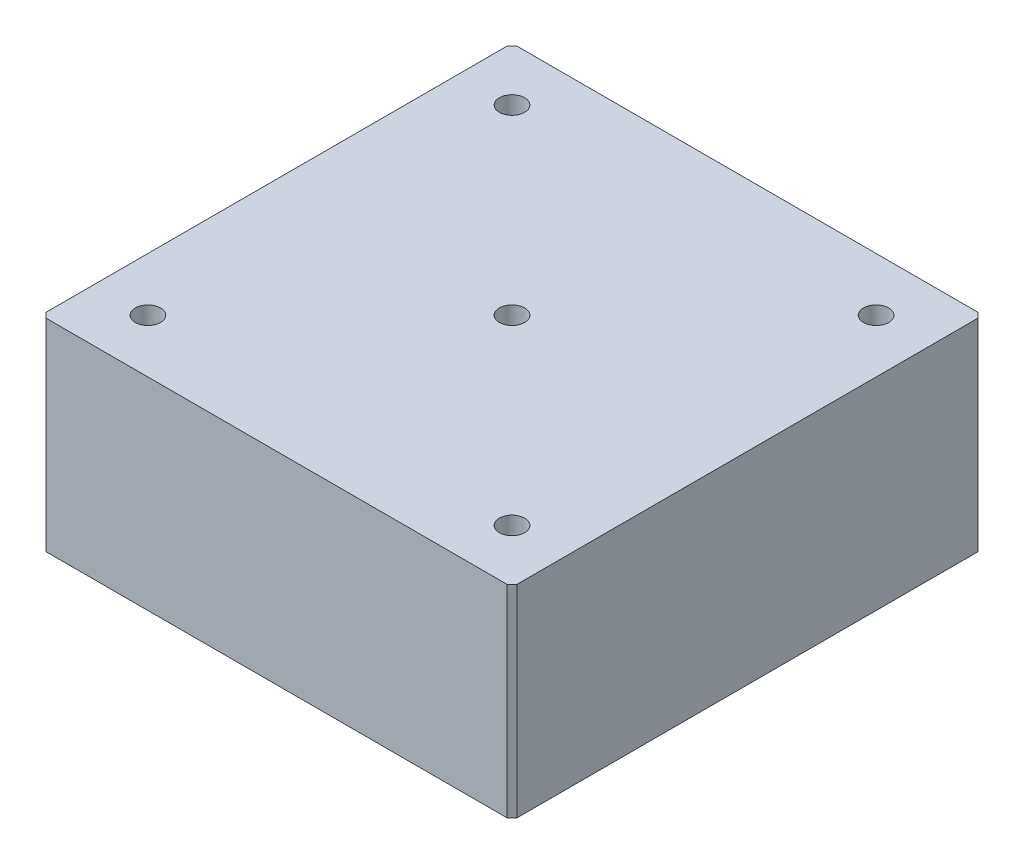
ISO-10303-21;
HEADER;
FILE_DESCRIPTION(('STEP AP214'),'2;1');
FILE_NAME('part.step','',(''),(''),'','','');
FILE_SCHEMA(('AUTOMOTIVE_DESIGN { 1 0 10303 214 1 1 1 1 }'));
ENDSEC;
DATA;
#1=APPLICATION_CONTEXT('core data for automotive mechanical design processes');
#2=APPLICATION_PROTOCOL_DEFINITION('international standard','automotive_design',2000,#1);
#3=PRODUCT_CONTEXT('',#1,'mechanical');
#4=PRODUCT('Part','Part','',(#3));
#5=PRODUCT_RELATED_PRODUCT_CATEGORY('part','',(#4));
#6=PRODUCT_DEFINITION_FORMATION('','',#4);
#7=PRODUCT_DEFINITION_CONTEXT('part definition',#1,'design');
#8=PRODUCT_DEFINITION('design','',#6,#7);
#9=PRODUCT_DEFINITION_SHAPE('','',#8);
#10=(LENGTH_UNIT() NAMED_UNIT(*) SI_UNIT(.MILLI.,.METRE.));
#11=(NAMED_UNIT(*) PLANE_ANGLE_UNIT() SI_UNIT($,.RADIAN.));
#12=(NAMED_UNIT(*) SI_UNIT($,.STERADIAN.) SOLID_ANGLE_UNIT());
#13=UNCERTAINTY_MEASURE_WITH_UNIT(LENGTH_MEASURE(1.E-05),#10,'distance_accuracy_value','');
#14=(GEOMETRIC_REPRESENTATION_CONTEXT(3) GLOBAL_UNCERTAINTY_ASSIGNED_CONTEXT((#13)) GLOBAL_UNIT_ASSIGNED_CONTEXT((#10,
#11,#12)) REPRESENTATION_CONTEXT('',''));
#15=CARTESIAN_POINT('',(0.,0.,0.));
#16=DIRECTION('',(0.,0.,1.));
#17=DIRECTION('',(1.,0.,0.));
#18=AXIS2_PLACEMENT_3D('',#15,#16,#17);
#19=CARTESIAN_POINT('',(147.88388,63.5,-147.88388));
#20=DIRECTION('',(0.,-1.,0.));
#21=DIRECTION('',(0.,0.,-1.));
#22=AXIS2_PLACEMENT_3D('',#19,#20,#21);
#23=PLANE('',#22);
#24=CARTESIAN_POINT('',(114.3,63.5,-114.3));
#25=DIRECTION('',(0.,1.,0.));
#26=DIRECTION('',(0.,0.,1.));
#27=AXIS2_PLACEMENT_3D('',#24,#25,#26);
#28=CIRCLE('',#27,7.9375);
#29=CARTESIAN_POINT('',(114.3,63.5,-106.3625));
#30=VERTEX_POINT('',#29);
#31=EDGE_CURVE('E219',#30,#30,#28,.T.);
#32=ORIENTED_EDGE('',*,*,#31,.F.);
#33=EDGE_LOOP('',(#32));
#34=FACE_BOUND('',#33,.T.);
#35=CARTESIAN_POINT('',(114.3,63.5,114.3));
#36=DIRECTION('',(0.,1.,0.));
#37=DIRECTION('',(0.,0.,1.));
#38=AXIS2_PLACEMENT_3D('',#35,#36,#37);
#39=CIRCLE('',#38,7.9375);
#40=CARTESIAN_POINT('',(114.3,63.5,122.2375));
#41=VERTEX_POINT('',#40);
#42=EDGE_CURVE('E207',#41,#41,#39,.T.);
#43=ORIENTED_EDGE('',*,*,#42,.F.);
#44=EDGE_LOOP('',(#43));
#45=FACE_BOUND('',#44,.T.);
#46=CARTESIAN_POINT('',(0.,63.5,0.));
#47=DIRECTION('',(0.,1.,0.));
#48=DIRECTION('',(0.,0.,1.));
#49=AXIS2_PLACEMENT_3D('',#46,#47,#48);
#50=CIRCLE('',#49,7.9375);
#51=CARTESIAN_POINT('',(0.,63.5,7.93749999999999));
#52=VERTEX_POINT('',#51);
#53=EDGE_CURVE('E195',#52,#52,#50,.T.);
#54=ORIENTED_EDGE('',*,*,#53,.F.);
#55=EDGE_LOOP('',(#54));
#56=FACE_BOUND('',#55,.T.);
#57=DIRECTION('',(0.,0.,1.));
#58=VECTOR('',#57,1.);
#59=CARTESIAN_POINT('',(-147.88388,63.5,147.88388));
#60=LINE('',#59,#58);
#61=CARTESIAN_POINT('',(-147.88388,63.5,-144.70888));
#62=VERTEX_POINT('',#61);
#63=CARTESIAN_POINT('',(-147.88388,63.5,144.70888));
#64=VERTEX_POINT('',#63);
#65=EDGE_CURVE('E100',#62,#64,#60,.T.);
#66=ORIENTED_EDGE('',*,*,#65,.T.);
#67=DIRECTION('',(-0.707106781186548,0.,-0.707106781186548));
#68=VECTOR('',#67,1.);
#69=CARTESIAN_POINT('',(-147.88388,63.5,144.70888));
#70=LINE('',#69,#68);
#71=CARTESIAN_POINT('',(-144.70888,63.5,147.88388));
#72=VERTEX_POINT('',#71);
#73=EDGE_CURVE('E128',#64,#72,#70,.F.);
#74=ORIENTED_EDGE('',*,*,#73,.T.);
#75=DIRECTION('',(1.,0.,0.));
#76=VECTOR('',#75,1.);
#77=CARTESIAN_POINT('',(-147.88388,63.5,147.88388));
#78=LINE('',#77,#76);
#79=CARTESIAN_POINT('',(144.70888,63.5,147.88388));
#80=VERTEX_POINT('',#79);
#81=EDGE_CURVE('E115',#72,#80,#78,.T.);
#82=ORIENTED_EDGE('',*,*,#81,.T.);
#83=DIRECTION('',(-0.707106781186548,0.,0.707106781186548));
#84=VECTOR('',#83,1.);
#85=CARTESIAN_POINT('',(144.70888,63.5,147.88388));
#86=LINE('',#85,#84);
#87=CARTESIAN_POINT('',(147.88388,63.5,144.70888));
#88=VERTEX_POINT('',#87);
#89=EDGE_CURVE('E126',#80,#88,#86,.F.);
#90=ORIENTED_EDGE('',*,*,#89,.T.);
#91=DIRECTION('',(0.,0.,-1.));
#92=VECTOR('',#91,1.);
#93=CARTESIAN_POINT('',(147.88388,63.5,147.88388));
#94=LINE('',#93,#92);
#95=CARTESIAN_POINT('',(147.88388,63.5,-144.70888));
#96=VERTEX_POINT('',#95);
#97=EDGE_CURVE('E156',#88,#96,#94,.T.);
#98=ORIENTED_EDGE('',*,*,#97,.T.);
#99=DIRECTION('',(0.707106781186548,0.,0.707106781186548));
#100=VECTOR('',#99,1.);
#101=CARTESIAN_POINT('',(147.88388,63.5,-144.70888));
#102=LINE('',#101,#100);
#103=CARTESIAN_POINT('',(144.70888,63.5,-147.88388));
#104=VERTEX_POINT('',#103);
#105=EDGE_CURVE('E106',#96,#104,#102,.F.);
#106=ORIENTED_EDGE('',*,*,#105,.T.);
#107=DIRECTION('',(-1.,0.,0.));
#108=VECTOR('',#107,1.);
#109=CARTESIAN_POINT('',(-147.88388,63.5,-147.88388));
#110=LINE('',#109,#108);
#111=CARTESIAN_POINT('',(-144.70888,63.5,-147.88388));
#112=VERTEX_POINT('',#111);
#113=EDGE_CURVE('E101',#104,#112,#110,.T.);
#114=ORIENTED_EDGE('',*,*,#113,.T.);
#115=DIRECTION('',(0.707106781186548,0.,-0.707106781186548));
#116=VECTOR('',#115,1.);
#117=CARTESIAN_POINT('',(-144.70888,63.5,-147.88388));
#118=LINE('',#117,#116);
#119=EDGE_CURVE('E97',#112,#62,#118,.F.);
#120=ORIENTED_EDGE('',*,*,#119,.T.);
#121=EDGE_LOOP('',(#66,#74,#82,#90,#98,#106,#114,#120));
#122=FACE_BOUND('',#121,.T.);
#123=CARTESIAN_POINT('',(-114.3,63.5,114.3));
#124=DIRECTION('',(0.,1.,0.));
#125=DIRECTION('',(0.,0.,1.));
#126=AXIS2_PLACEMENT_3D('',#123,#124,#125);
#127=CIRCLE('',#126,7.9375);
#128=CARTESIAN_POINT('',(-114.3,63.5,122.2375));
#129=VERTEX_POINT('',#128);
#130=EDGE_CURVE('E171',#129,#129,#127,.T.);
#131=ORIENTED_EDGE('',*,*,#130,.F.);
#132=EDGE_LOOP('',(#131));
#133=FACE_BOUND('',#132,.T.);
#134=CARTESIAN_POINT('',(-114.3,63.5,-114.3));
#135=DIRECTION('',(0.,1.,0.));
#136=DIRECTION('',(0.,0.,1.));
#137=AXIS2_PLACEMENT_3D('',#134,#135,#136);
#138=CIRCLE('',#137,7.9375);
#139=CARTESIAN_POINT('',(-114.3,63.5,-106.3625));
#140=VERTEX_POINT('',#139);
#141=EDGE_CURVE('E183',#140,#140,#138,.T.);
#142=ORIENTED_EDGE('',*,*,#141,.F.);
#143=EDGE_LOOP('',(#142));
#144=FACE_BOUND('',#143,.T.);
#145=ADVANCED_FACE('F32',(#34,#45,#56,#122,#133,#144),#23,.F.);
#146=CARTESIAN_POINT('',(147.88388,-63.5,147.88388));
#147=DIRECTION('',(1.,0.,0.));
#148=DIRECTION('',(0.,0.,-1.));
#149=AXIS2_PLACEMENT_3D('',#146,#147,#148);
#150=PLANE('',#149);
#151=ORIENTED_EDGE('',*,*,#97,.F.);
#152=DIRECTION('',(0.,-1.,0.));
#153=VECTOR('',#152,1.);
#154=CARTESIAN_POINT('',(147.88388,-63.5,144.70888));
#155=LINE('',#154,#153);
#156=CARTESIAN_POINT('',(147.88388,-63.5,144.70888));
#157=VERTEX_POINT('',#156);
#158=EDGE_CURVE('E145',#88,#157,#155,.T.);
#159=ORIENTED_EDGE('',*,*,#158,.T.);
#160=DIRECTION('',(0.,0.,-1.));
#161=VECTOR('',#160,1.);
#162=CARTESIAN_POINT('',(147.88388,-63.5,147.88388));
#163=LINE('',#162,#161);
#164=CARTESIAN_POINT('',(147.88388,-63.5,-144.70888));
#165=VERTEX_POINT('',#164);
#166=EDGE_CURVE('E149',#157,#165,#163,.T.);
#167=ORIENTED_EDGE('',*,*,#166,.T.);
#168=DIRECTION('',(0.,1.,0.));
#169=VECTOR('',#168,1.);
#170=CARTESIAN_POINT('',(147.88388,-63.5,-144.70888));
#171=LINE('',#170,#169);
#172=EDGE_CURVE('E142',#165,#96,#171,.T.);
#173=ORIENTED_EDGE('',*,*,#172,.T.);
#174=EDGE_LOOP('',(#151,#159,#167,#173));
#175=FACE_BOUND('',#174,.T.);
#176=ADVANCED_FACE('F227',(#175),#150,.T.);
#177=CARTESIAN_POINT('',(-147.88388,-63.5,147.88388));
#178=DIRECTION('',(0.,0.,1.));
#179=DIRECTION('',(1.,0.,0.));
#180=AXIS2_PLACEMENT_3D('',#177,#178,#179);
#181=PLANE('',#180);
#182=ORIENTED_EDGE('',*,*,#81,.F.);
#183=DIRECTION('',(0.,-1.,0.));
#184=VECTOR('',#183,1.);
#185=CARTESIAN_POINT('',(-144.70888,-63.5,147.88388));
#186=LINE('',#185,#184);
#187=CARTESIAN_POINT('',(-144.70888,-63.5,147.88388));
#188=VERTEX_POINT('',#187);
#189=EDGE_CURVE('E133',#72,#188,#186,.T.);
#190=ORIENTED_EDGE('',*,*,#189,.T.);
#191=DIRECTION('',(1.,0.,0.));
#192=VECTOR('',#191,1.);
#193=CARTESIAN_POINT('',(-147.88388,-63.5,147.88388));
#194=LINE('',#193,#192);
#195=CARTESIAN_POINT('',(144.70888,-63.5,147.88388));
#196=VERTEX_POINT('',#195);
#197=EDGE_CURVE('E117',#188,#196,#194,.T.);
#198=ORIENTED_EDGE('',*,*,#197,.T.);
#199=DIRECTION('',(0.,1.,0.));
#200=VECTOR('',#199,1.);
#201=CARTESIAN_POINT('',(144.70888,-63.5,147.88388));
#202=LINE('',#201,#200);
#203=EDGE_CURVE('E130',#196,#80,#202,.T.);
#204=ORIENTED_EDGE('',*,*,#203,.T.);
#205=EDGE_LOOP('',(#182,#190,#198,#204));
#206=FACE_BOUND('',#205,.T.);
#207=ADVANCED_FACE('F284',(#206),#181,.T.);
#208=CARTESIAN_POINT('',(-147.88388,-63.5,147.88388));
#209=DIRECTION('',(-1.,0.,0.));
#210=DIRECTION('',(0.,0.,1.));
#211=AXIS2_PLACEMENT_3D('',#208,#209,#210);
#212=PLANE('',#211);
#213=DIRECTION('',(0.,0.,1.));
#214=VECTOR('',#213,1.);
#215=CARTESIAN_POINT('',(-147.88388,-63.5,147.88388));
#216=LINE('',#215,#214);
#217=CARTESIAN_POINT('',(-147.88388,-63.5,-144.70888));
#218=VERTEX_POINT('',#217);
#219=CARTESIAN_POINT('',(-147.88388,-63.5,144.70888));
#220=VERTEX_POINT('',#219);
#221=EDGE_CURVE('E121',#218,#220,#216,.T.);
#222=ORIENTED_EDGE('',*,*,#221,.T.);
#223=DIRECTION('',(0.,1.,0.));
#224=VECTOR('',#223,1.);
#225=CARTESIAN_POINT('',(-147.88388,-63.5,144.70888));
#226=LINE('',#225,#224);
#227=EDGE_CURVE('E107',#220,#64,#226,.T.);
#228=ORIENTED_EDGE('',*,*,#227,.T.);
#229=ORIENTED_EDGE('',*,*,#65,.F.);
#230=DIRECTION('',(0.,-1.,0.));
#231=VECTOR('',#230,1.);
#232=CARTESIAN_POINT('',(-147.88388,-63.5,-144.70888));
#233=LINE('',#232,#231);
#234=EDGE_CURVE('E113',#62,#218,#233,.T.);
#235=ORIENTED_EDGE('',*,*,#234,.T.);
#236=EDGE_LOOP('',(#222,#228,#229,#235));
#237=FACE_BOUND('',#236,.T.);
#238=ADVANCED_FACE('F112',(#237),#212,.T.);
#239=CARTESIAN_POINT('',(-147.88388,-63.5,-147.88388));
#240=DIRECTION('',(0.,0.,-1.));
#241=DIRECTION('',(-1.,0.,0.));
#242=AXIS2_PLACEMENT_3D('',#239,#240,#241);
#243=PLANE('',#242);
#244=ORIENTED_EDGE('',*,*,#113,.F.);
#245=DIRECTION('',(0.,-1.,0.));
#246=VECTOR('',#245,1.);
#247=CARTESIAN_POINT('',(144.70888,-63.5,-147.88388));
#248=LINE('',#247,#246);
#249=CARTESIAN_POINT('',(144.70888,-63.5,-147.88388));
#250=VERTEX_POINT('',#249);
#251=EDGE_CURVE('E11',#104,#250,#248,.T.);
#252=ORIENTED_EDGE('',*,*,#251,.T.);
#253=DIRECTION('',(-1.,0.,0.));
#254=VECTOR('',#253,1.);
#255=CARTESIAN_POINT('',(-147.88388,-63.5,-147.88388));
#256=LINE('',#255,#254);
#257=CARTESIAN_POINT('',(-144.70888,-63.5,-147.88388));
#258=VERTEX_POINT('',#257);
#259=EDGE_CURVE('E147',#250,#258,#256,.T.);
#260=ORIENTED_EDGE('',*,*,#259,.T.);
#261=DIRECTION('',(0.,1.,0.));
#262=VECTOR('',#261,1.);
#263=CARTESIAN_POINT('',(-144.70888,-63.5,-147.88388));
#264=LINE('',#263,#262);
#265=EDGE_CURVE('E40',#258,#112,#264,.T.);
#266=ORIENTED_EDGE('',*,*,#265,.T.);
#267=EDGE_LOOP('',(#244,#252,#260,#266));
#268=FACE_BOUND('',#267,.T.);
#269=ADVANCED_FACE('F146',(#268),#243,.T.);
#270=CARTESIAN_POINT('',(147.88388,-63.5,-147.88388));
#271=DIRECTION('',(0.,-1.,0.));
#272=DIRECTION('',(0.,0.,-1.));
#273=AXIS2_PLACEMENT_3D('',#270,#271,#272);
#274=PLANE('',#273);
#275=CARTESIAN_POINT('',(114.3,-63.5,-114.3));
#276=DIRECTION('',(0.,1.,0.));
#277=DIRECTION('',(0.,0.,1.));
#278=AXIS2_PLACEMENT_3D('',#275,#276,#277);
#279=CIRCLE('',#278,3.37819999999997);
#280=CARTESIAN_POINT('',(114.3,-63.5,-110.9218));
#281=VERTEX_POINT('',#280);
#282=EDGE_CURVE('E210',#281,#281,#279,.T.);
#283=ORIENTED_EDGE('',*,*,#282,.T.);
#284=EDGE_LOOP('',(#283));
#285=FACE_BOUND('',#284,.T.);
#286=CARTESIAN_POINT('',(114.3,-63.5,114.3));
#287=DIRECTION('',(0.,1.,0.));
#288=DIRECTION('',(0.,0.,1.));
#289=AXIS2_PLACEMENT_3D('',#286,#287,#288);
#290=CIRCLE('',#289,3.37819999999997);
#291=CARTESIAN_POINT('',(114.3,-63.5,117.6782));
#292=VERTEX_POINT('',#291);
#293=EDGE_CURVE('E198',#292,#292,#290,.T.);
#294=ORIENTED_EDGE('',*,*,#293,.T.);
#295=EDGE_LOOP('',(#294));
#296=FACE_BOUND('',#295,.T.);
#297=CARTESIAN_POINT('',(0.,-63.5,0.));
#298=DIRECTION('',(0.,1.,0.));
#299=DIRECTION('',(0.,0.,1.));
#300=AXIS2_PLACEMENT_3D('',#297,#298,#299);
#301=CIRCLE('',#300,3.37819999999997);
#302=CARTESIAN_POINT('',(0.,-63.5,3.37819999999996));
#303=VERTEX_POINT('',#302);
#304=EDGE_CURVE('E186',#303,#303,#301,.T.);
#305=ORIENTED_EDGE('',*,*,#304,.T.);
#306=EDGE_LOOP('',(#305));
#307=FACE_BOUND('',#306,.T.);
#308=CARTESIAN_POINT('',(-114.3,-63.5,-114.3));
#309=DIRECTION('',(0.,1.,0.));
#310=DIRECTION('',(0.,0.,1.));
#311=AXIS2_PLACEMENT_3D('',#308,#309,#310);
#312=CIRCLE('',#311,3.37819999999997);
#313=CARTESIAN_POINT('',(-114.3,-63.5,-110.9218));
#314=VERTEX_POINT('',#313);
#315=EDGE_CURVE('E174',#314,#314,#312,.T.);
#316=ORIENTED_EDGE('',*,*,#315,.T.);
#317=EDGE_LOOP('',(#316));
#318=FACE_BOUND('',#317,.T.);
#319=CARTESIAN_POINT('',(-114.3,-63.5,114.3));
#320=DIRECTION('',(0.,1.,0.));
#321=DIRECTION('',(0.,0.,1.));
#322=AXIS2_PLACEMENT_3D('',#319,#320,#321);
#323=CIRCLE('',#322,3.37819999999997);
#324=CARTESIAN_POINT('',(-114.3,-63.5,117.6782));
#325=VERTEX_POINT('',#324);
#326=EDGE_CURVE('E159',#325,#325,#323,.T.);
#327=ORIENTED_EDGE('',*,*,#326,.T.);
#328=EDGE_LOOP('',(#327));
#329=FACE_BOUND('',#328,.T.);
#330=ORIENTED_EDGE('',*,*,#197,.F.);
#331=DIRECTION('',(0.707106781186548,0.,0.707106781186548));
#332=VECTOR('',#331,1.);
#333=CARTESIAN_POINT('',(-146.29638,-63.5,146.29638));
#334=LINE('',#333,#332);
#335=EDGE_CURVE('E140',#188,#220,#334,.F.);
#336=ORIENTED_EDGE('',*,*,#335,.T.);
#337=ORIENTED_EDGE('',*,*,#221,.F.);
#338=DIRECTION('',(-0.707106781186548,0.,0.707106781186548));
#339=VECTOR('',#338,1.);
#340=CARTESIAN_POINT('',(1.58749999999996,-63.5,-294.18026));
#341=LINE('',#340,#339);
#342=EDGE_CURVE('E47',#218,#258,#341,.F.);
#343=ORIENTED_EDGE('',*,*,#342,.T.);
#344=ORIENTED_EDGE('',*,*,#259,.F.);
#345=DIRECTION('',(-0.707106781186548,0.,-0.707106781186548));
#346=VECTOR('',#345,1.);
#347=CARTESIAN_POINT('',(146.29638,-63.5,-146.29638));
#348=LINE('',#347,#346);
#349=EDGE_CURVE('E136',#250,#165,#348,.F.);
#350=ORIENTED_EDGE('',*,*,#349,.T.);
#351=ORIENTED_EDGE('',*,*,#166,.F.);
#352=DIRECTION('',(0.707106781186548,0.,-0.707106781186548));
#353=VECTOR('',#352,1.);
#354=CARTESIAN_POINT('',(294.18026,-63.5,-1.58749999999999));
#355=LINE('',#354,#353);
#356=EDGE_CURVE('E138',#157,#196,#355,.F.);
#357=ORIENTED_EDGE('',*,*,#356,.T.);
#358=EDGE_LOOP('',(#330,#336,#337,#343,#344,#350,#351,#357));
#359=FACE_BOUND('',#358,.T.);
#360=ADVANCED_FACE('F279',(#285,#296,#307,#318,#329,#359),#274,.T.);
#361=CARTESIAN_POINT('',(-147.88388,-63.5,144.70888));
#362=DIRECTION('',(0.707106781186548,0.,-0.707106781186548));
#363=DIRECTION('',(-0.707106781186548,0.,-0.707106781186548));
#364=AXIS2_PLACEMENT_3D('',#361,#362,#363);
#365=PLANE('',#364);
#366=ORIENTED_EDGE('',*,*,#335,.F.);
#367=ORIENTED_EDGE('',*,*,#189,.F.);
#368=ORIENTED_EDGE('',*,*,#73,.F.);
#369=ORIENTED_EDGE('',*,*,#227,.F.);
#370=EDGE_LOOP('',(#366,#367,#368,#369));
#371=FACE_BOUND('',#370,.T.);
#372=ADVANCED_FACE('F281',(#371),#365,.F.);
#373=CARTESIAN_POINT('',(144.70888,-63.5,147.88388));
#374=DIRECTION('',(-0.707106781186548,0.,-0.707106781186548));
#375=DIRECTION('',(-0.707106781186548,0.,0.707106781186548));
#376=AXIS2_PLACEMENT_3D('',#373,#374,#375);
#377=PLANE('',#376);
#378=ORIENTED_EDGE('',*,*,#356,.F.);
#379=ORIENTED_EDGE('',*,*,#158,.F.);
#380=ORIENTED_EDGE('',*,*,#89,.F.);
#381=ORIENTED_EDGE('',*,*,#203,.F.);
#382=EDGE_LOOP('',(#378,#379,#380,#381));
#383=FACE_BOUND('',#382,.T.);
#384=ADVANCED_FACE('F297',(#383),#377,.F.);
#385=CARTESIAN_POINT('',(147.88388,-63.5,-144.70888));
#386=DIRECTION('',(-0.707106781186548,0.,0.707106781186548));
#387=DIRECTION('',(0.707106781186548,0.,0.707106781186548));
#388=AXIS2_PLACEMENT_3D('',#385,#386,#387);
#389=PLANE('',#388);
#390=ORIENTED_EDGE('',*,*,#349,.F.);
#391=ORIENTED_EDGE('',*,*,#251,.F.);
#392=ORIENTED_EDGE('',*,*,#105,.F.);
#393=ORIENTED_EDGE('',*,*,#172,.F.);
#394=EDGE_LOOP('',(#390,#391,#392,#393));
#395=FACE_BOUND('',#394,.T.);
#396=ADVANCED_FACE('F300',(#395),#389,.F.);
#397=CARTESIAN_POINT('',(-144.70888,-63.5,-147.88388));
#398=DIRECTION('',(0.707106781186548,0.,0.707106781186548));
#399=DIRECTION('',(0.707106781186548,0.,-0.707106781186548));
#400=AXIS2_PLACEMENT_3D('',#397,#398,#399);
#401=PLANE('',#400);
#402=ORIENTED_EDGE('',*,*,#342,.F.);
#403=ORIENTED_EDGE('',*,*,#234,.F.);
#404=ORIENTED_EDGE('',*,*,#119,.F.);
#405=ORIENTED_EDGE('',*,*,#265,.F.);
#406=EDGE_LOOP('',(#402,#403,#404,#405));
#407=FACE_BOUND('',#406,.T.);
#408=ADVANCED_FACE('F34',(#407),#401,.F.);
#409=CARTESIAN_POINT('',(-114.3,63.5,114.3));
#410=DIRECTION('',(0.,1.,0.));
#411=DIRECTION('',(0.,0.,1.));
#412=AXIS2_PLACEMENT_3D('',#409,#410,#411);
#413=CYLINDRICAL_SURFACE('',#412,3.37819999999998);
#414=ORIENTED_EDGE('',*,*,#326,.F.);
#415=EDGE_LOOP('',(#414));
#416=FACE_BOUND('',#415,.T.);
#417=CARTESIAN_POINT('',(-114.3,-11.176,114.3));
#418=DIRECTION('',(0.,1.,0.));
#419=DIRECTION('',(0.,0.,1.));
#420=AXIS2_PLACEMENT_3D('',#417,#418,#419);
#421=CIRCLE('',#420,3.37819999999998);
#422=CARTESIAN_POINT('',(-114.3,-11.176,117.6782));
#423=VERTEX_POINT('',#422);
#424=EDGE_CURVE('E162',#423,#423,#421,.T.);
#425=ORIENTED_EDGE('',*,*,#424,.T.);
#426=EDGE_LOOP('',(#425));
#427=FACE_BOUND('',#426,.T.);
#428=ADVANCED_FACE('F274',(#416,#427),#413,.F.);
#429=CARTESIAN_POINT('',(-110.9218,-11.176,114.3));
#430=DIRECTION('',(0.,-1.,0.));
#431=DIRECTION('',(0.,0.,-1.));
#432=AXIS2_PLACEMENT_3D('',#429,#430,#431);
#433=PLANE('',#432);
#434=ORIENTED_EDGE('',*,*,#424,.F.);
#435=EDGE_LOOP('',(#434));
#436=FACE_BOUND('',#435,.T.);
#437=CARTESIAN_POINT('',(-114.3,-11.176,114.3));
#438=DIRECTION('',(0.,1.,0.));
#439=DIRECTION('',(0.,0.,1.));
#440=AXIS2_PLACEMENT_3D('',#437,#438,#439);
#441=CIRCLE('',#440,7.93749999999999);
#442=CARTESIAN_POINT('',(-114.3,-11.176,122.2375));
#443=VERTEX_POINT('',#442);
#444=EDGE_CURVE('E166',#443,#443,#441,.T.);
#445=ORIENTED_EDGE('',*,*,#444,.T.);
#446=EDGE_LOOP('',(#445));
#447=FACE_BOUND('',#446,.T.);
#448=ADVANCED_FACE('F270',(#436,#447),#433,.F.);
#449=CARTESIAN_POINT('',(-114.3,63.5,114.3));
#450=DIRECTION('',(0.,1.,0.));
#451=DIRECTION('',(0.,0.,1.));
#452=AXIS2_PLACEMENT_3D('',#449,#450,#451);
#453=CYLINDRICAL_SURFACE('',#452,7.93749999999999);
#454=ORIENTED_EDGE('',*,*,#444,.F.);
#455=EDGE_LOOP('',(#454));
#456=FACE_BOUND('',#455,.T.);
#457=ORIENTED_EDGE('',*,*,#130,.T.);
#458=EDGE_LOOP('',(#457));
#459=FACE_BOUND('',#458,.T.);
#460=ADVANCED_FACE('F266',(#456,#459),#453,.F.);
#461=CARTESIAN_POINT('',(-114.3,63.5,-114.3));
#462=DIRECTION('',(0.,1.,0.));
#463=DIRECTION('',(0.,0.,1.));
#464=AXIS2_PLACEMENT_3D('',#461,#462,#463);
#465=CYLINDRICAL_SURFACE('',#464,3.37819999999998);
#466=ORIENTED_EDGE('',*,*,#315,.F.);
#467=EDGE_LOOP('',(#466));
#468=FACE_BOUND('',#467,.T.);
#469=CARTESIAN_POINT('',(-114.3,-11.176,-114.3));
#470=DIRECTION('',(0.,1.,0.));
#471=DIRECTION('',(0.,0.,1.));
#472=AXIS2_PLACEMENT_3D('',#469,#470,#471);
#473=CIRCLE('',#472,3.37819999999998);
#474=CARTESIAN_POINT('',(-114.3,-11.176,-110.9218));
#475=VERTEX_POINT('',#474);
#476=EDGE_CURVE('E177',#475,#475,#473,.T.);
#477=ORIENTED_EDGE('',*,*,#476,.T.);
#478=EDGE_LOOP('',(#477));
#479=FACE_BOUND('',#478,.T.);
#480=ADVANCED_FACE('F262',(#468,#479),#465,.F.);
#481=CARTESIAN_POINT('',(-110.9218,-11.176,-114.3));
#482=DIRECTION('',(0.,-1.,0.));
#483=DIRECTION('',(0.,0.,-1.));
#484=AXIS2_PLACEMENT_3D('',#481,#482,#483);
#485=PLANE('',#484);
#486=ORIENTED_EDGE('',*,*,#476,.F.);
#487=EDGE_LOOP('',(#486));
#488=FACE_BOUND('',#487,.T.);
#489=CARTESIAN_POINT('',(-114.3,-11.176,-114.3));
#490=DIRECTION('',(0.,1.,0.));
#491=DIRECTION('',(0.,0.,1.));
#492=AXIS2_PLACEMENT_3D('',#489,#490,#491);
#493=CIRCLE('',#492,7.93749999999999);
#494=CARTESIAN_POINT('',(-114.3,-11.176,-106.3625));
#495=VERTEX_POINT('',#494);
#496=EDGE_CURVE('E180',#495,#495,#493,.T.);
#497=ORIENTED_EDGE('',*,*,#496,.T.);
#498=EDGE_LOOP('',(#497));
#499=FACE_BOUND('',#498,.T.);
#500=ADVANCED_FACE('F258',(#488,#499),#485,.F.);
#501=CARTESIAN_POINT('',(-114.3,63.5,-114.3));
#502=DIRECTION('',(0.,1.,0.));
#503=DIRECTION('',(0.,0.,1.));
#504=AXIS2_PLACEMENT_3D('',#501,#502,#503);
#505=CYLINDRICAL_SURFACE('',#504,7.93749999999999);
#506=ORIENTED_EDGE('',*,*,#496,.F.);
#507=EDGE_LOOP('',(#506));
#508=FACE_BOUND('',#507,.T.);
#509=ORIENTED_EDGE('',*,*,#141,.T.);
#510=EDGE_LOOP('',(#509));
#511=FACE_BOUND('',#510,.T.);
#512=ADVANCED_FACE('F254',(#508,#511),#505,.F.);
#513=CARTESIAN_POINT('',(0.,63.5,0.));
#514=DIRECTION('',(0.,1.,0.));
#515=DIRECTION('',(0.,0.,1.));
#516=AXIS2_PLACEMENT_3D('',#513,#514,#515);
#517=CYLINDRICAL_SURFACE('',#516,3.37819999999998);
#518=ORIENTED_EDGE('',*,*,#304,.F.);
#519=EDGE_LOOP('',(#518));
#520=FACE_BOUND('',#519,.T.);
#521=CARTESIAN_POINT('',(0.,-11.176,0.));
#522=DIRECTION('',(0.,1.,0.));
#523=DIRECTION('',(0.,0.,1.));
#524=AXIS2_PLACEMENT_3D('',#521,#522,#523);
#525=CIRCLE('',#524,3.37819999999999);
#526=CARTESIAN_POINT('',(0.,-11.176,3.37819999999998));
#527=VERTEX_POINT('',#526);
#528=EDGE_CURVE('E189',#527,#527,#525,.T.);
#529=ORIENTED_EDGE('',*,*,#528,.T.);
#530=EDGE_LOOP('',(#529));
#531=FACE_BOUND('',#530,.T.);
#532=ADVANCED_FACE('F246',(#520,#531),#517,.F.);
#533=CARTESIAN_POINT('',(3.37819999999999,-11.176,0.));
#534=DIRECTION('',(0.,-1.,0.));
#535=DIRECTION('',(0.,0.,-1.));
#536=AXIS2_PLACEMENT_3D('',#533,#534,#535);
#537=PLANE('',#536);
#538=ORIENTED_EDGE('',*,*,#528,.F.);
#539=EDGE_LOOP('',(#538));
#540=FACE_BOUND('',#539,.T.);
#541=CARTESIAN_POINT('',(0.,-11.176,0.));
#542=DIRECTION('',(0.,1.,0.));
#543=DIRECTION('',(0.,0.,1.));
#544=AXIS2_PLACEMENT_3D('',#541,#542,#543);
#545=CIRCLE('',#544,7.93749999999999);
#546=CARTESIAN_POINT('',(0.,-11.176,7.93749999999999));
#547=VERTEX_POINT('',#546);
#548=EDGE_CURVE('E192',#547,#547,#545,.T.);
#549=ORIENTED_EDGE('',*,*,#548,.T.);
#550=EDGE_LOOP('',(#549));
#551=FACE_BOUND('',#550,.T.);
#552=ADVANCED_FACE('F236',(#540,#551),#537,.F.);
#553=CARTESIAN_POINT('',(0.,63.5,0.));
#554=DIRECTION('',(0.,1.,0.));
#555=DIRECTION('',(0.,0.,1.));
#556=AXIS2_PLACEMENT_3D('',#553,#554,#555);
#557=CYLINDRICAL_SURFACE('',#556,7.93749999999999);
#558=ORIENTED_EDGE('',*,*,#548,.F.);
#559=EDGE_LOOP('',(#558));
#560=FACE_BOUND('',#559,.T.);
#561=ORIENTED_EDGE('',*,*,#53,.T.);
#562=EDGE_LOOP('',(#561));
#563=FACE_BOUND('',#562,.T.);
#564=ADVANCED_FACE('F233',(#560,#563),#557,.F.);
#565=CARTESIAN_POINT('',(114.3,63.5,114.3));
#566=DIRECTION('',(0.,1.,0.));
#567=DIRECTION('',(0.,0.,1.));
#568=AXIS2_PLACEMENT_3D('',#565,#566,#567);
#569=CYLINDRICAL_SURFACE('',#568,3.37819999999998);
#570=ORIENTED_EDGE('',*,*,#293,.F.);
#571=EDGE_LOOP('',(#570));
#572=FACE_BOUND('',#571,.T.);
#573=CARTESIAN_POINT('',(114.3,-11.176,114.3));
#574=DIRECTION('',(0.,1.,0.));
#575=DIRECTION('',(0.,0.,1.));
#576=AXIS2_PLACEMENT_3D('',#573,#574,#575);
#577=CIRCLE('',#576,3.37819999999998);
#578=CARTESIAN_POINT('',(114.3,-11.176,117.6782));
#579=VERTEX_POINT('',#578);
#580=EDGE_CURVE('E201',#579,#579,#577,.T.);
#581=ORIENTED_EDGE('',*,*,#580,.T.);
#582=EDGE_LOOP('',(#581));
#583=FACE_BOUND('',#582,.T.);
#584=ADVANCED_FACE('F235',(#572,#583),#569,.F.);
#585=CARTESIAN_POINT('',(117.6782,-11.176,114.3));
#586=DIRECTION('',(0.,-1.,0.));
#587=DIRECTION('',(0.,0.,-1.));
#588=AXIS2_PLACEMENT_3D('',#585,#586,#587);
#589=PLANE('',#588);
#590=ORIENTED_EDGE('',*,*,#580,.F.);
#591=EDGE_LOOP('',(#590));
#592=FACE_BOUND('',#591,.T.);
#593=CARTESIAN_POINT('',(114.3,-11.176,114.3));
#594=DIRECTION('',(0.,1.,0.));
#595=DIRECTION('',(0.,0.,1.));
#596=AXIS2_PLACEMENT_3D('',#593,#594,#595);
#597=CIRCLE('',#596,7.93749999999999);
#598=CARTESIAN_POINT('',(114.3,-11.176,122.2375));
#599=VERTEX_POINT('',#598);
#600=EDGE_CURVE('E204',#599,#599,#597,.T.);
#601=ORIENTED_EDGE('',*,*,#600,.T.);
#602=EDGE_LOOP('',(#601));
#603=FACE_BOUND('',#602,.T.);
#604=ADVANCED_FACE('F243',(#592,#603),#589,.F.);
#605=CARTESIAN_POINT('',(114.3,63.5,114.3));
#606=DIRECTION('',(0.,1.,0.));
#607=DIRECTION('',(0.,0.,1.));
#608=AXIS2_PLACEMENT_3D('',#605,#606,#607);
#609=CYLINDRICAL_SURFACE('',#608,7.93749999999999);
#610=ORIENTED_EDGE('',*,*,#600,.F.);
#611=EDGE_LOOP('',(#610));
#612=FACE_BOUND('',#611,.T.);
#613=ORIENTED_EDGE('',*,*,#42,.T.);
#614=EDGE_LOOP('',(#613));
#615=FACE_BOUND('',#614,.T.);
#616=ADVANCED_FACE('F372',(#612,#615),#609,.F.);
#617=CARTESIAN_POINT('',(114.3,63.5,-114.3));
#618=DIRECTION('',(0.,1.,0.));
#619=DIRECTION('',(0.,0.,1.));
#620=AXIS2_PLACEMENT_3D('',#617,#618,#619);
#621=CYLINDRICAL_SURFACE('',#620,3.37819999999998);
#622=ORIENTED_EDGE('',*,*,#282,.F.);
#623=EDGE_LOOP('',(#622));
#624=FACE_BOUND('',#623,.T.);
#625=CARTESIAN_POINT('',(114.3,-11.176,-114.3));
#626=DIRECTION('',(0.,1.,0.));
#627=DIRECTION('',(0.,0.,1.));
#628=AXIS2_PLACEMENT_3D('',#625,#626,#627);
#629=CIRCLE('',#628,3.37819999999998);
#630=CARTESIAN_POINT('',(114.3,-11.176,-110.9218));
#631=VERTEX_POINT('',#630);
#632=EDGE_CURVE('E213',#631,#631,#629,.T.);
#633=ORIENTED_EDGE('',*,*,#632,.T.);
#634=EDGE_LOOP('',(#633));
#635=FACE_BOUND('',#634,.T.);
#636=ADVANCED_FACE('F381',(#624,#635),#621,.F.);
#637=CARTESIAN_POINT('',(117.6782,-11.176,-114.3));
#638=DIRECTION('',(0.,-1.,0.));
#639=DIRECTION('',(0.,0.,-1.));
#640=AXIS2_PLACEMENT_3D('',#637,#638,#639);
#641=PLANE('',#640);
#642=ORIENTED_EDGE('',*,*,#632,.F.);
#643=EDGE_LOOP('',(#642));
#644=FACE_BOUND('',#643,.T.);
#645=CARTESIAN_POINT('',(114.3,-11.176,-114.3));
#646=DIRECTION('',(0.,1.,0.));
#647=DIRECTION('',(0.,0.,1.));
#648=AXIS2_PLACEMENT_3D('',#645,#646,#647);
#649=CIRCLE('',#648,7.93749999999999);
#650=CARTESIAN_POINT('',(114.3,-11.176,-106.3625));
#651=VERTEX_POINT('',#650);
#652=EDGE_CURVE('E216',#651,#651,#649,.T.);
#653=ORIENTED_EDGE('',*,*,#652,.T.);
#654=EDGE_LOOP('',(#653));
#655=FACE_BOUND('',#654,.T.);
#656=ADVANCED_FACE('F391',(#644,#655),#641,.F.);
#657=CARTESIAN_POINT('',(114.3,63.5,-114.3));
#658=DIRECTION('',(0.,1.,0.));
#659=DIRECTION('',(0.,0.,1.));
#660=AXIS2_PLACEMENT_3D('',#657,#658,#659);
#661=CYLINDRICAL_SURFACE('',#660,7.93749999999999);
#662=ORIENTED_EDGE('',*,*,#652,.F.);
#663=EDGE_LOOP('',(#662));
#664=FACE_BOUND('',#663,.T.);
#665=ORIENTED_EDGE('',*,*,#31,.T.);
#666=EDGE_LOOP('',(#665));
#667=FACE_BOUND('',#666,.T.);
#668=ADVANCED_FACE('F223',(#664,#667),#661,.F.);
#669=CLOSED_SHELL('',(#145,#176,#207,#238,#269,#360,#372,#384,#396,#408,#428,#448,#460,#480,
#500,#512,#532,#552,#564,#584,#604,#616,#636,#656,#668));
#670=MANIFOLD_SOLID_BREP('B2',#669);
#671=ADVANCED_BREP_SHAPE_REPRESENTATION('',(#18,#670),#14);
#672=SHAPE_DEFINITION_REPRESENTATION(#9,#671);
ENDSEC;
END-ISO-10303-21;
